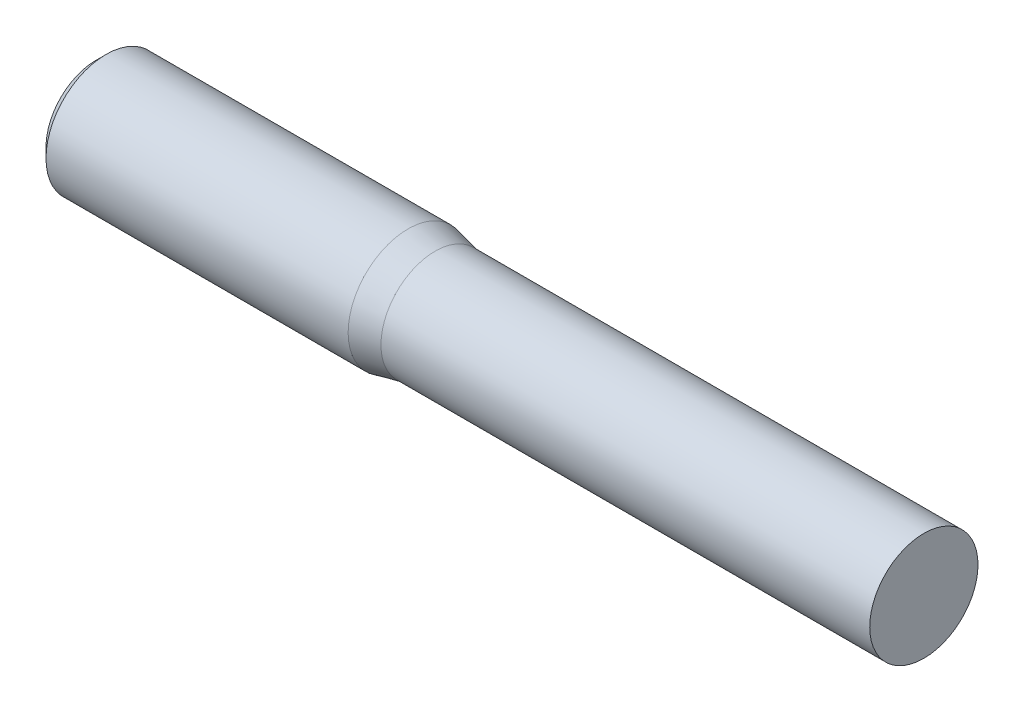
ISO-10303-21;
HEADER;
FILE_DESCRIPTION(('STEP AP214'),'2;1');
FILE_NAME('part.step','',(''),(''),'','','');
FILE_SCHEMA(('AUTOMOTIVE_DESIGN { 1 0 10303 214 1 1 1 1 }'));
ENDSEC;
DATA;
#1=APPLICATION_CONTEXT('core data for automotive mechanical design processes');
#2=APPLICATION_PROTOCOL_DEFINITION('international standard','automotive_design',2000,#1);
#3=PRODUCT_CONTEXT('',#1,'mechanical');
#4=PRODUCT('Part','Part','',(#3));
#5=PRODUCT_RELATED_PRODUCT_CATEGORY('part','',(#4));
#6=PRODUCT_DEFINITION_FORMATION('','',#4);
#7=PRODUCT_DEFINITION_CONTEXT('part definition',#1,'design');
#8=PRODUCT_DEFINITION('design','',#6,#7);
#9=PRODUCT_DEFINITION_SHAPE('','',#8);
#10=(LENGTH_UNIT() NAMED_UNIT(*) SI_UNIT(.MILLI.,.METRE.));
#11=(NAMED_UNIT(*) PLANE_ANGLE_UNIT() SI_UNIT($,.RADIAN.));
#12=(NAMED_UNIT(*) SI_UNIT($,.STERADIAN.) SOLID_ANGLE_UNIT());
#13=UNCERTAINTY_MEASURE_WITH_UNIT(LENGTH_MEASURE(1.E-05),#10,'distance_accuracy_value','');
#14=(GEOMETRIC_REPRESENTATION_CONTEXT(3) GLOBAL_UNCERTAINTY_ASSIGNED_CONTEXT((#13)) GLOBAL_UNIT_ASSIGNED_CONTEXT((#10,
#11,#12)) REPRESENTATION_CONTEXT('',''));
#15=CARTESIAN_POINT('',(0.,0.,0.));
#16=DIRECTION('',(0.,0.,1.));
#17=DIRECTION('',(1.,0.,0.));
#18=AXIS2_PLACEMENT_3D('',#15,#16,#17);
#19=CARTESIAN_POINT('',(0.,0.,0.));
#20=DIRECTION('',(1.,0.,0.));
#21=DIRECTION('',(0.,0.,-1.));
#22=AXIS2_PLACEMENT_3D('',#19,#20,#21);
#23=PLANE('',#22);
#24=CARTESIAN_POINT('',(0.,0.,0.));
#25=DIRECTION('',(1.,0.,0.));
#26=DIRECTION('',(0.,0.,-1.));
#27=AXIS2_PLACEMENT_3D('',#24,#25,#26);
#28=CIRCLE('',#27,4.18799999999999);
#29=CARTESIAN_POINT('',(0.,0.,-4.18799999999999));
#30=VERTEX_POINT('',#29);
#31=EDGE_CURVE('E40',#30,#30,#28,.F.);
#32=ORIENTED_EDGE('',*,*,#31,.T.);
#33=EDGE_LOOP('',(#32));
#34=FACE_BOUND('',#33,.T.);
#35=ADVANCED_FACE('F33',(#34),#23,.F.);
#36=CARTESIAN_POINT('',(0.,0.,0.));
#37=DIRECTION('',(-1.,0.,0.));
#38=DIRECTION('',(0.,0.,1.));
#39=AXIS2_PLACEMENT_3D('',#36,#37,#38);
#40=CYLINDRICAL_SURFACE('',#39,5.);
#41=CARTESIAN_POINT('',(0.812000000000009,0.,0.));
#42=DIRECTION('',(1.,0.,0.));
#43=DIRECTION('',(0.,0.,-1.));
#44=AXIS2_PLACEMENT_3D('',#41,#42,#43);
#45=CIRCLE('',#44,5.);
#46=CARTESIAN_POINT('',(0.812000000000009,0.,-5.));
#47=VERTEX_POINT('',#46);
#48=EDGE_CURVE('E10',#47,#47,#45,.T.);
#49=ORIENTED_EDGE('',*,*,#48,.T.);
#50=EDGE_LOOP('',(#49));
#51=FACE_BOUND('',#50,.T.);
#52=CARTESIAN_POINT('',(26.,0.,0.));
#53=DIRECTION('',(-1.,0.,0.));
#54=DIRECTION('',(0.,0.,1.));
#55=AXIS2_PLACEMENT_3D('',#52,#53,#54);
#56=CIRCLE('',#55,5.);
#57=CARTESIAN_POINT('',(26.,0.,5.));
#58=VERTEX_POINT('',#57);
#59=EDGE_CURVE('E44',#58,#58,#56,.T.);
#60=ORIENTED_EDGE('',*,*,#59,.T.);
#61=EDGE_LOOP('',(#60));
#62=FACE_BOUND('',#61,.T.);
#63=ADVANCED_FACE('F69',(#51,#62),#40,.T.);
#64=CARTESIAN_POINT('',(28.25,0.,0.));
#65=DIRECTION('',(-1.,0.,0.));
#66=DIRECTION('',(0.,0.,1.));
#67=AXIS2_PLACEMENT_3D('',#64,#65,#66);
#68=CONICAL_SURFACE('',#67,4.513,0.213156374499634);
#69=ORIENTED_EDGE('',*,*,#59,.F.);
#70=EDGE_LOOP('',(#69));
#71=FACE_BOUND('',#70,.T.);
#72=CARTESIAN_POINT('',(28.25,0.,0.));
#73=DIRECTION('',(-1.,0.,0.));
#74=DIRECTION('',(0.,0.,1.));
#75=AXIS2_PLACEMENT_3D('',#72,#73,#74);
#76=CIRCLE('',#75,4.513);
#77=CARTESIAN_POINT('',(28.25,0.,4.513));
#78=VERTEX_POINT('',#77);
#79=EDGE_CURVE('E48',#78,#78,#76,.T.);
#80=ORIENTED_EDGE('',*,*,#79,.T.);
#81=EDGE_LOOP('',(#80));
#82=FACE_BOUND('',#81,.T.);
#83=ADVANCED_FACE('F61',(#71,#82),#68,.T.);
#84=CARTESIAN_POINT('',(0.,0.,0.));
#85=DIRECTION('',(-1.,0.,0.));
#86=DIRECTION('',(0.,0.,1.));
#87=AXIS2_PLACEMENT_3D('',#84,#85,#86);
#88=CYLINDRICAL_SURFACE('',#87,4.513);
#89=ORIENTED_EDGE('',*,*,#79,.F.);
#90=EDGE_LOOP('',(#89));
#91=FACE_BOUND('',#90,.T.);
#92=CARTESIAN_POINT('',(69.,0.,0.));
#93=DIRECTION('',(1.,0.,0.));
#94=DIRECTION('',(0.,0.,-1.));
#95=AXIS2_PLACEMENT_3D('',#92,#93,#94);
#96=CIRCLE('',#95,4.513);
#97=CARTESIAN_POINT('',(69.,0.,-4.513));
#98=VERTEX_POINT('',#97);
#99=EDGE_CURVE('E53',#98,#98,#96,.T.);
#100=ORIENTED_EDGE('',*,*,#99,.F.);
#101=EDGE_LOOP('',(#100));
#102=FACE_BOUND('',#101,.T.);
#103=ADVANCED_FACE('F59',(#91,#102),#88,.T.);
#104=CARTESIAN_POINT('',(0.,0.,0.));
#105=DIRECTION('',(1.,0.,0.));
#106=DIRECTION('',(0.,0.,-1.));
#107=AXIS2_PLACEMENT_3D('',#104,#105,#106);
#108=CONICAL_SURFACE('',#107,4.18799999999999,0.785398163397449);
#109=ORIENTED_EDGE('',*,*,#48,.F.);
#110=EDGE_LOOP('',(#109));
#111=FACE_BOUND('',#110,.T.);
#112=ORIENTED_EDGE('',*,*,#31,.F.);
#113=EDGE_LOOP('',(#112));
#114=FACE_BOUND('',#113,.T.);
#115=ADVANCED_FACE('F35',(#111,#114),#108,.T.);
#116=CARTESIAN_POINT('',(69.,0.,0.));
#117=DIRECTION('',(1.,0.,0.));
#118=DIRECTION('',(0.,0.,-1.));
#119=AXIS2_PLACEMENT_3D('',#116,#117,#118);
#120=PLANE('',#119);
#121=ORIENTED_EDGE('',*,*,#99,.T.);
#122=EDGE_LOOP('',(#121));
#123=FACE_BOUND('',#122,.T.);
#124=ADVANCED_FACE('F57',(#123),#120,.T.);
#125=CLOSED_SHELL('',(#35,#63,#83,#103,#115,#124));
#126=MANIFOLD_SOLID_BREP('B2',#125);
#127=ADVANCED_BREP_SHAPE_REPRESENTATION('',(#18,#126),#14);
#128=SHAPE_DEFINITION_REPRESENTATION(#9,#127);
ENDSEC;
END-ISO-10303-21;
